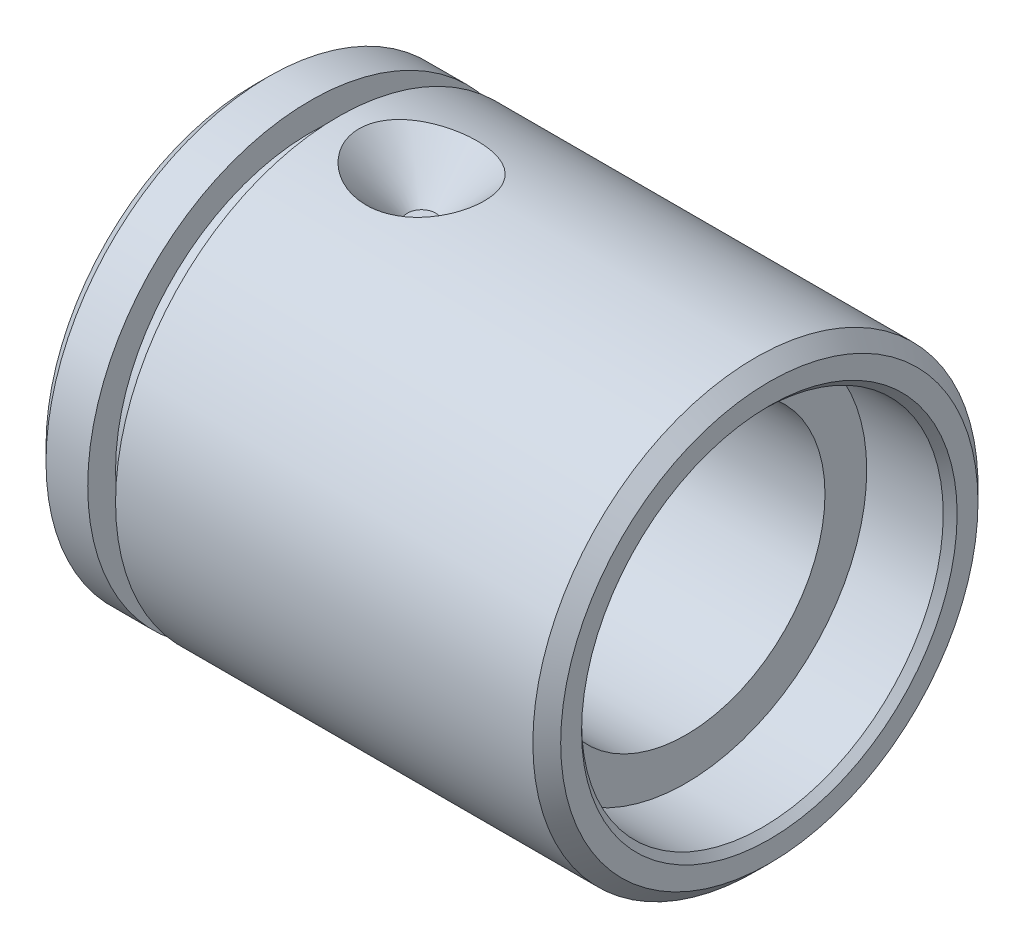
ISO-10303-21;
HEADER;
FILE_DESCRIPTION(('STEP AP214'),'2;1');
FILE_NAME('part.step','',(''),(''),'','','');
FILE_SCHEMA(('AUTOMOTIVE_DESIGN { 1 0 10303 214 1 1 1 1 }'));
ENDSEC;
DATA;
#1=APPLICATION_CONTEXT('core data for automotive mechanical design processes');
#2=APPLICATION_PROTOCOL_DEFINITION('international standard','automotive_design',2000,#1);
#3=PRODUCT_CONTEXT('',#1,'mechanical');
#4=PRODUCT('Part','Part','',(#3));
#5=PRODUCT_RELATED_PRODUCT_CATEGORY('part','',(#4));
#6=PRODUCT_DEFINITION_FORMATION('','',#4);
#7=PRODUCT_DEFINITION_CONTEXT('part definition',#1,'design');
#8=PRODUCT_DEFINITION('design','',#6,#7);
#9=PRODUCT_DEFINITION_SHAPE('','',#8);
#10=(LENGTH_UNIT() NAMED_UNIT(*) SI_UNIT(.MILLI.,.METRE.));
#11=(NAMED_UNIT(*) PLANE_ANGLE_UNIT() SI_UNIT($,.RADIAN.));
#12=(NAMED_UNIT(*) SI_UNIT($,.STERADIAN.) SOLID_ANGLE_UNIT());
#13=UNCERTAINTY_MEASURE_WITH_UNIT(LENGTH_MEASURE(1.E-05),#10,'distance_accuracy_value','');
#14=(GEOMETRIC_REPRESENTATION_CONTEXT(3) GLOBAL_UNCERTAINTY_ASSIGNED_CONTEXT((#13)) GLOBAL_UNIT_ASSIGNED_CONTEXT((#10,
#11,#12)) REPRESENTATION_CONTEXT('',''));
#15=CARTESIAN_POINT('',(0.,0.,0.));
#16=DIRECTION('',(0.,0.,1.));
#17=DIRECTION('',(1.,0.,0.));
#18=AXIS2_PLACEMENT_3D('',#15,#16,#17);
#19=CARTESIAN_POINT('',(37.,0.,0.));
#20=DIRECTION('',(-1.,0.,0.));
#21=DIRECTION('',(0.,0.,1.));
#22=AXIS2_PLACEMENT_3D('',#19,#20,#21);
#23=CYLINDRICAL_SURFACE('',#22,10.);
#24=CARTESIAN_POINT('',(0.5,0.,0.));
#25=DIRECTION('',(1.,0.,0.));
#26=DIRECTION('',(0.,0.,-1.));
#27=AXIS2_PLACEMENT_3D('',#24,#25,#26);
#28=CIRCLE('',#27,10.);
#29=CARTESIAN_POINT('',(0.5,0.,-10.));
#30=VERTEX_POINT('',#29);
#31=EDGE_CURVE('E353',#30,#30,#28,.F.);
#32=ORIENTED_EDGE('',*,*,#31,.T.);
#33=EDGE_LOOP('',(#32));
#34=FACE_BOUND('',#33,.T.);
#35=CARTESIAN_POINT('',(31.,0.,0.));
#36=DIRECTION('',(1.,0.,0.));
#37=DIRECTION('',(0.,0.,-1.));
#38=AXIS2_PLACEMENT_3D('',#35,#36,#37);
#39=CIRCLE('',#38,10.);
#40=CARTESIAN_POINT('',(31.,0.,-10.));
#41=VERTEX_POINT('',#40);
#42=EDGE_CURVE('E454',#41,#41,#39,.F.);
#43=ORIENTED_EDGE('',*,*,#42,.F.);
#44=EDGE_LOOP('',(#43));
#45=FACE_BOUND('',#44,.T.);
#46=ADVANCED_FACE('F346',(#34,#45),#23,.F.);
#47=CARTESIAN_POINT('',(37.,16.,0.));
#48=DIRECTION('',(-1.,0.,0.));
#49=DIRECTION('',(0.,0.,1.));
#50=AXIS2_PLACEMENT_3D('',#47,#48,#49);
#51=PLANE('',#50);
#52=CARTESIAN_POINT('',(37.,0.,0.));
#53=DIRECTION('',(-1.,0.,0.));
#54=DIRECTION('',(0.,0.,1.));
#55=AXIS2_PLACEMENT_3D('',#52,#53,#54);
#56=CIRCLE('',#55,13.5);
#57=CARTESIAN_POINT('',(37.,0.,13.5));
#58=VERTEX_POINT('',#57);
#59=EDGE_CURVE('E357',#58,#58,#56,.T.);
#60=ORIENTED_EDGE('',*,*,#59,.T.);
#61=EDGE_LOOP('',(#60));
#62=FACE_BOUND('',#61,.T.);
#63=CARTESIAN_POINT('',(37.,0.,0.));
#64=DIRECTION('',(-1.,0.,0.));
#65=DIRECTION('',(0.,0.,1.));
#66=AXIS2_PLACEMENT_3D('',#63,#64,#65);
#67=CIRCLE('',#66,15.);
#68=CARTESIAN_POINT('',(37.,0.,15.));
#69=VERTEX_POINT('',#68);
#70=EDGE_CURVE('E451',#69,#69,#67,.F.);
#71=ORIENTED_EDGE('',*,*,#70,.T.);
#72=EDGE_LOOP('',(#71));
#73=FACE_BOUND('',#72,.T.);
#74=ADVANCED_FACE('F348',(#62,#73),#51,.F.);
#75=CARTESIAN_POINT('',(-7.,0.,0.));
#76=DIRECTION('',(-1.,0.,0.));
#77=DIRECTION('',(0.,0.,1.));
#78=AXIS2_PLACEMENT_3D('',#75,#76,#77);
#79=CYLINDRICAL_SURFACE('',#78,16.);
#80=CARTESIAN_POINT('',(9.0552587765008,15.7135972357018,-3.01378337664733));
#81=CARTESIAN_POINT('',(9.26037503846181,15.6832908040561,-3.17181220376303));
#82=CARTESIAN_POINT('',(9.4796245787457,15.6539405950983,-3.31202043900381));
#83=CARTESIAN_POINT('',(9.93902972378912,15.6006630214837,-3.55454733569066));
#84=CARTESIAN_POINT('',(10.1792222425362,15.5767455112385,-3.65679735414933));
#85=CARTESIAN_POINT('',(10.6744522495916,15.5370170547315,-3.82209155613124));
#86=CARTESIAN_POINT('',(10.9295450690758,15.5212387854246,-3.8849779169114));
#87=CARTESIAN_POINT('',(11.4467160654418,15.4997310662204,-3.969920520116));
#88=CARTESIAN_POINT('',(11.7087914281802,15.493997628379,-3.99199296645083));
#89=CARTESIAN_POINT('',(12.2433860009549,15.4932057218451,-3.99507351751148));
#90=CARTESIAN_POINT('',(12.5159167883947,15.4985690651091,-3.9744589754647));
#91=CARTESIAN_POINT('',(13.0536345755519,15.5201846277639,-3.88918644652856));
#92=CARTESIAN_POINT('',(13.3188195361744,15.5364398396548,-3.82451635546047));
#93=CARTESIAN_POINT('',(13.8344440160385,15.5778798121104,-3.65205455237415));
#94=CARTESIAN_POINT('',(14.0848652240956,15.6030754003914,-3.54421053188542));
#95=CARTESIAN_POINT('',(14.5628354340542,15.6592767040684,-3.28699294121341));
#96=CARTESIAN_POINT('',(14.7903823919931,15.6902829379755,-3.13761566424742));
#97=CARTESIAN_POINT('',(15.2068917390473,15.7529772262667,-2.80556774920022));
#98=CARTESIAN_POINT('',(15.396912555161,15.7846050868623,-2.62421990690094));
#99=CARTESIAN_POINT('',(15.7393657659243,15.845303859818,-2.22849689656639));
#100=CARTESIAN_POINT('',(15.8918306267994,15.8743769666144,-2.01415051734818));
#101=CARTESIAN_POINT('',(16.1366949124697,15.9228773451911,-1.5824055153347));
#102=CARTESIAN_POINT('',(16.2337445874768,15.9429999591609,-1.36773255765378));
#103=CARTESIAN_POINT('',(16.384856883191,15.974887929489,-0.923213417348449));
#104=CARTESIAN_POINT('',(16.4389721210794,15.9866635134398,-0.693386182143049));
#105=CARTESIAN_POINT('',(16.4964329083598,15.9992027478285,-0.258067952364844));
#106=CARTESIAN_POINT('',(16.5055251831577,16.0012122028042,-0.053357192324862));
#107=CARTESIAN_POINT('',(16.4880204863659,15.9973714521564,0.354428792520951));
#108=CARTESIAN_POINT('',(16.4614332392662,15.9915233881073,0.557504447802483));
#109=CARTESIAN_POINT('',(16.3763510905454,15.9731586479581,0.945557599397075));
#110=CARTESIAN_POINT('',(16.3195521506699,15.9609971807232,1.13092993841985));
#111=CARTESIAN_POINT('',(16.1778736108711,15.9314799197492,1.49012031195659));
#112=CARTESIAN_POINT('',(16.0929891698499,15.9141232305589,1.66393634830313));
#113=CARTESIAN_POINT('',(15.8925905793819,15.8746600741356,2.00667157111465));
#114=CARTESIAN_POINT('',(15.7755354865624,15.8523299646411,2.17466014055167));
#115=CARTESIAN_POINT('',(15.517794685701,15.8057039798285,2.49105382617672));
#116=CARTESIAN_POINT('',(15.3770986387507,15.7814072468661,2.63945032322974));
#117=CARTESIAN_POINT('',(15.0578787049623,15.7299474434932,2.93143994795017));
#118=CARTESIAN_POINT('',(14.8768379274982,15.7027929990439,3.07228292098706));
#119=CARTESIAN_POINT('',(14.4953568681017,15.6511798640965,3.32524673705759));
#120=CARTESIAN_POINT('',(14.2949073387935,15.6267224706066,3.43735379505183));
#121=CARTESIAN_POINT('',(13.8562498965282,15.5802763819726,3.64243147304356));
#122=CARTESIAN_POINT('',(13.6163243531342,15.5588674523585,3.73187215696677));
#123=CARTESIAN_POINT('',(13.1249279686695,15.5244732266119,3.87246425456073));
#124=CARTESIAN_POINT('',(12.8734540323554,15.5114902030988,3.92360533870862));
#125=CARTESIAN_POINT('',(12.3511724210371,15.4949128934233,3.98859894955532));
#126=CARTESIAN_POINT('',(12.0800666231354,15.4918800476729,4.00022294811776));
#127=CARTESIAN_POINT('',(11.5396027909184,15.4971508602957,3.9797497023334));
#128=CARTESIAN_POINT('',(11.2702449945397,15.5054560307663,3.9476466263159));
#129=CARTESIAN_POINT('',(10.7379583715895,15.532548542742,3.83966819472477));
#130=CARTESIAN_POINT('',(10.4751289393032,15.5514468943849,3.76332898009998));
#131=CARTESIAN_POINT('',(9.96662342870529,15.5974859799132,3.56769965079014));
#132=CARTESIAN_POINT('',(9.72095041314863,15.6246281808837,3.44840189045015));
#133=CARTESIAN_POINT('',(9.25872710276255,15.6832443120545,3.17104879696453));
#134=CARTESIAN_POINT('',(9.04175478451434,15.7146372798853,3.01368257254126));
#135=CARTESIAN_POINT('',(8.64036797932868,15.7780560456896,2.6617264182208));
#136=CARTESIAN_POINT('',(8.455940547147,15.8100815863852,2.46715135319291));
#137=CARTESIAN_POINT('',(8.14152290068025,15.8678445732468,2.06156628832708));
#138=CARTESIAN_POINT('',(8.00839843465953,15.8938781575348,1.85304069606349));
#139=CARTESIAN_POINT('',(7.7849812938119,15.9389600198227,1.4135193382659));
#140=CARTESIAN_POINT('',(7.69463096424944,15.9580176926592,1.18255432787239));
#141=CARTESIAN_POINT('',(7.5718005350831,15.9842809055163,0.73853002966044));
#142=CARTESIAN_POINT('',(7.53317265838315,15.9927355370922,0.527238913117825));
#143=CARTESIAN_POINT('',(7.49496599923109,16.0010964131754,0.101026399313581));
#144=CARTESIAN_POINT('',(7.49536249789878,16.0010080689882,-0.113892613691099));
#145=CARTESIAN_POINT('',(7.53330560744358,15.9927078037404,-0.520529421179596));
#146=CARTESIAN_POINT('',(7.56749047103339,15.9852310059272,-0.712588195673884));
#147=CARTESIAN_POINT('',(7.66630748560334,15.9640513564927,-1.08834393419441));
#148=CARTESIAN_POINT('',(7.73094673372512,15.9503470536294,-1.27203893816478));
#149=CARTESIAN_POINT('',(7.8895455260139,15.9177180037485,-1.63079567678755));
#150=CARTESIAN_POINT('',(7.9841442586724,15.8986806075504,-1.80556230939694));
#151=CARTESIAN_POINT('',(8.19836805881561,15.8573445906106,-2.13840315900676));
#152=CARTESIAN_POINT('',(8.31798181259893,15.8350474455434,-2.29648487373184));
#153=CARTESIAN_POINT('',(8.53970249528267,15.79591467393,-2.5495655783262));
#154=CARTESIAN_POINT('',(8.63647481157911,15.7794213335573,-2.64936560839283));
#155=CARTESIAN_POINT('',(8.83922814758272,15.746392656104,-2.83908155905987));
#156=CARTESIAN_POINT('',(8.94520928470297,15.7298573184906,-2.92899735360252));
#157=CARTESIAN_POINT('',(9.0552587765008,15.7135972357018,-3.01378337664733));
#158=B_SPLINE_CURVE_WITH_KNOTS('',3,(#80,#81,#82,#83,#84,#85,#86,#87,#88,#89,#90,#91,#92,#93,
#94,#95,#96,#97,#98,#99,#100,#101,#102,#103,#104,#105,#106,#107,#108,#109,#110,#111,#112,#113,
#114,#115,#116,#117,#118,#119,#120,#121,#122,#123,#124,#125,#126,#127,#128,#129,#130,#131,#132,
#133,#134,#135,#136,#137,#138,#139,#140,#141,#142,#143,#144,#145,#146,#147,#148,#149,#150,#151,
#152,#153,#154,#155,#156,#157),.UNSPECIFIED.,.T.,.F.,(4,2,2,2,2,2,2,2,2,2,2,2,2,2,2,2,2,2,2,2,2,
2,2,2,2,2,2,2,2,2,2,2,2,2,2,2,2,2,4),(0.,0.781580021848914,1.56456663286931,2.3506727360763,
3.13646667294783,3.95267816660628,4.76911400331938,5.58654202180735,6.40404301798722,
7.19340815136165,7.98208848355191,8.68727070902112,9.39158737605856,10.0031652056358,
10.6145763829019,11.1948141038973,11.7751518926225,12.3905586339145,13.0062352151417,
13.6963522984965,14.3867998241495,15.1542710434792,15.9219491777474,16.7322599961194,
17.5426788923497,18.3617536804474,19.1809743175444,19.9863494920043,20.791403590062,
21.5333424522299,22.2742783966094,22.9155873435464,23.5564900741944,24.1394528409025,
24.722551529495,25.3190397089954,25.9152586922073,26.3345886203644,26.7539238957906),.UNSPECIFIED.);
#159=CARTESIAN_POINT('',(9.0552587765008,15.7135972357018,-3.01378337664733));
#160=VERTEX_POINT('',#159);
#161=EDGE_CURVE('E364',#160,#160,#158,.T.);
#162=ORIENTED_EDGE('',*,*,#161,.T.);
#163=EDGE_LOOP('',(#162));
#164=FACE_BOUND('',#163,.T.);
#165=CARTESIAN_POINT('',(36.,0.,0.));
#166=DIRECTION('',(-1.,0.,0.));
#167=DIRECTION('',(0.,0.,1.));
#168=AXIS2_PLACEMENT_3D('',#165,#166,#167);
#169=CIRCLE('',#168,16.);
#170=CARTESIAN_POINT('',(36.,0.,16.));
#171=VERTEX_POINT('',#170);
#172=EDGE_CURVE('E448',#171,#171,#169,.T.);
#173=ORIENTED_EDGE('',*,*,#172,.T.);
#174=EDGE_LOOP('',(#173));
#175=FACE_BOUND('',#174,.T.);
#176=CARTESIAN_POINT('',(6.,0.,0.));
#177=DIRECTION('',(-1.,0.,0.));
#178=DIRECTION('',(0.,0.,1.));
#179=AXIS2_PLACEMENT_3D('',#176,#177,#178);
#180=CIRCLE('',#179,16.);
#181=CARTESIAN_POINT('',(6.,0.,16.));
#182=VERTEX_POINT('',#181);
#183=EDGE_CURVE('E435',#182,#182,#180,.T.);
#184=ORIENTED_EDGE('',*,*,#183,.F.);
#185=EDGE_LOOP('',(#184));
#186=FACE_BOUND('',#185,.T.);
#187=ADVANCED_FACE('F372',(#164,#175,#186),#79,.T.);
#188=CARTESIAN_POINT('',(6.,14.,0.));
#189=DIRECTION('',(1.,0.,0.));
#190=DIRECTION('',(0.,0.,-1.));
#191=AXIS2_PLACEMENT_3D('',#188,#189,#190);
#192=PLANE('',#191);
#193=CARTESIAN_POINT('',(6.,0.,0.));
#194=DIRECTION('',(-1.,0.,0.));
#195=DIRECTION('',(0.,0.,1.));
#196=AXIS2_PLACEMENT_3D('',#193,#194,#195);
#197=CIRCLE('',#196,14.);
#198=CARTESIAN_POINT('',(6.,0.,14.));
#199=VERTEX_POINT('',#198);
#200=EDGE_CURVE('E432',#199,#199,#197,.T.);
#201=ORIENTED_EDGE('',*,*,#200,.F.);
#202=EDGE_LOOP('',(#201));
#203=FACE_BOUND('',#202,.T.);
#204=ORIENTED_EDGE('',*,*,#183,.T.);
#205=EDGE_LOOP('',(#204));
#206=FACE_BOUND('',#205,.T.);
#207=ADVANCED_FACE('F421',(#203,#206),#192,.F.);
#208=CARTESIAN_POINT('',(-7.,0.,0.));
#209=DIRECTION('',(-1.,0.,0.));
#210=DIRECTION('',(0.,0.,1.));
#211=AXIS2_PLACEMENT_3D('',#208,#209,#210);
#212=CYLINDRICAL_SURFACE('',#211,14.);
#213=CARTESIAN_POINT('',(4.,0.,0.));
#214=DIRECTION('',(-1.,0.,0.));
#215=DIRECTION('',(0.,0.,1.));
#216=AXIS2_PLACEMENT_3D('',#213,#214,#215);
#217=CIRCLE('',#216,14.);
#218=CARTESIAN_POINT('',(4.,0.,14.));
#219=VERTEX_POINT('',#218);
#220=EDGE_CURVE('E442',#219,#219,#217,.T.);
#221=ORIENTED_EDGE('',*,*,#220,.F.);
#222=EDGE_LOOP('',(#221));
#223=FACE_BOUND('',#222,.T.);
#224=ORIENTED_EDGE('',*,*,#200,.T.);
#225=EDGE_LOOP('',(#224));
#226=FACE_BOUND('',#225,.T.);
#227=ADVANCED_FACE('F418',(#223,#226),#212,.T.);
#228=CARTESIAN_POINT('',(4.,16.,0.));
#229=DIRECTION('',(-1.,0.,0.));
#230=DIRECTION('',(0.,0.,1.));
#231=AXIS2_PLACEMENT_3D('',#228,#229,#230);
#232=PLANE('',#231);
#233=CARTESIAN_POINT('',(4.,0.,0.));
#234=DIRECTION('',(-1.,0.,0.));
#235=DIRECTION('',(0.,0.,1.));
#236=AXIS2_PLACEMENT_3D('',#233,#234,#235);
#237=CIRCLE('',#236,16.);
#238=CARTESIAN_POINT('',(4.,0.,16.));
#239=VERTEX_POINT('',#238);
#240=EDGE_CURVE('E456',#239,#239,#237,.T.);
#241=ORIENTED_EDGE('',*,*,#240,.F.);
#242=EDGE_LOOP('',(#241));
#243=FACE_BOUND('',#242,.T.);
#244=ORIENTED_EDGE('',*,*,#220,.T.);
#245=EDGE_LOOP('',(#244));
#246=FACE_BOUND('',#245,.T.);
#247=ADVANCED_FACE('F414',(#243,#246),#232,.F.);
#248=CARTESIAN_POINT('',(-7.,0.,0.));
#249=DIRECTION('',(-1.,0.,0.));
#250=DIRECTION('',(0.,0.,1.));
#251=AXIS2_PLACEMENT_3D('',#248,#249,#250);
#252=CYLINDRICAL_SURFACE('',#251,16.);
#253=CARTESIAN_POINT('',(1.00000000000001,0.,0.));
#254=DIRECTION('',(1.,0.,0.));
#255=DIRECTION('',(0.,0.,-1.));
#256=AXIS2_PLACEMENT_3D('',#253,#254,#255);
#257=CIRCLE('',#256,16.);
#258=CARTESIAN_POINT('',(1.00000000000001,0.,-16.));
#259=VERTEX_POINT('',#258);
#260=EDGE_CURVE('E440',#259,#259,#257,.T.);
#261=ORIENTED_EDGE('',*,*,#260,.T.);
#262=EDGE_LOOP('',(#261));
#263=FACE_BOUND('',#262,.T.);
#264=ORIENTED_EDGE('',*,*,#240,.T.);
#265=EDGE_LOOP('',(#264));
#266=FACE_BOUND('',#265,.T.);
#267=ADVANCED_FACE('F411',(#263,#266),#252,.T.);
#268=CARTESIAN_POINT('',(0.,0.,0.));
#269=DIRECTION('',(1.,0.,0.));
#270=DIRECTION('',(0.,0.,-1.));
#271=AXIS2_PLACEMENT_3D('',#268,#269,#270);
#272=PLANE('',#271);
#273=CARTESIAN_POINT('',(0.,0.,0.));
#274=DIRECTION('',(1.,0.,0.));
#275=DIRECTION('',(0.,0.,-1.));
#276=AXIS2_PLACEMENT_3D('',#273,#274,#275);
#277=CIRCLE('',#276,10.5);
#278=CARTESIAN_POINT('',(0.,0.,-10.5));
#279=VERTEX_POINT('',#278);
#280=EDGE_CURVE('E10',#279,#279,#277,.T.);
#281=ORIENTED_EDGE('',*,*,#280,.T.);
#282=EDGE_LOOP('',(#281));
#283=FACE_BOUND('',#282,.T.);
#284=CARTESIAN_POINT('',(0.,0.,0.));
#285=DIRECTION('',(1.,0.,0.));
#286=DIRECTION('',(0.,0.,-1.));
#287=AXIS2_PLACEMENT_3D('',#284,#285,#286);
#288=CIRCLE('',#287,15.);
#289=CARTESIAN_POINT('',(0.,0.,-15.));
#290=VERTEX_POINT('',#289);
#291=EDGE_CURVE('E437',#290,#290,#288,.F.);
#292=ORIENTED_EDGE('',*,*,#291,.T.);
#293=EDGE_LOOP('',(#292));
#294=FACE_BOUND('',#293,.T.);
#295=ADVANCED_FACE('F407',(#283,#294),#272,.F.);
#296=CARTESIAN_POINT('',(0.,0.,0.));
#297=DIRECTION('',(1.,0.,0.));
#298=DIRECTION('',(0.,0.,-1.));
#299=AXIS2_PLACEMENT_3D('',#296,#297,#298);
#300=CONICAL_SURFACE('',#299,15.,0.785398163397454);
#301=ORIENTED_EDGE('',*,*,#260,.F.);
#302=EDGE_LOOP('',(#301));
#303=FACE_BOUND('',#302,.T.);
#304=ORIENTED_EDGE('',*,*,#291,.F.);
#305=EDGE_LOOP('',(#304));
#306=FACE_BOUND('',#305,.T.);
#307=ADVANCED_FACE('F403',(#303,#306),#300,.T.);
#308=CARTESIAN_POINT('',(36.,0.,0.));
#309=DIRECTION('',(-1.,0.,0.));
#310=DIRECTION('',(0.,0.,1.));
#311=AXIS2_PLACEMENT_3D('',#308,#309,#310);
#312=CONICAL_SURFACE('',#311,16.,0.785398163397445);
#313=ORIENTED_EDGE('',*,*,#70,.F.);
#314=EDGE_LOOP('',(#313));
#315=FACE_BOUND('',#314,.T.);
#316=ORIENTED_EDGE('',*,*,#172,.F.);
#317=EDGE_LOOP('',(#316));
#318=FACE_BOUND('',#317,.T.);
#319=ADVANCED_FACE('F394',(#315,#318),#312,.T.);
#320=CARTESIAN_POINT('',(31.,0.,0.));
#321=DIRECTION('',(1.,0.,0.));
#322=DIRECTION('',(0.,0.,-1.));
#323=AXIS2_PLACEMENT_3D('',#320,#321,#322);
#324=PLANE('',#323);
#325=CARTESIAN_POINT('',(31.,0.,0.));
#326=DIRECTION('',(1.,0.,0.));
#327=DIRECTION('',(0.,0.,-1.));
#328=AXIS2_PLACEMENT_3D('',#325,#326,#327);
#329=CIRCLE('',#328,13.);
#330=CARTESIAN_POINT('',(31.,0.,-13.));
#331=VERTEX_POINT('',#330);
#332=EDGE_CURVE('E369',#331,#331,#329,.T.);
#333=ORIENTED_EDGE('',*,*,#332,.T.);
#334=EDGE_LOOP('',(#333));
#335=FACE_BOUND('',#334,.T.);
#336=ORIENTED_EDGE('',*,*,#42,.T.);
#337=EDGE_LOOP('',(#336));
#338=FACE_BOUND('',#337,.T.);
#339=ADVANCED_FACE('F391',(#335,#338),#324,.T.);
#340=CARTESIAN_POINT('',(31.,0.,0.));
#341=DIRECTION('',(1.,0.,0.));
#342=DIRECTION('',(0.,0.,-1.));
#343=AXIS2_PLACEMENT_3D('',#340,#341,#342);
#344=CYLINDRICAL_SURFACE('',#343,13.);
#345=CARTESIAN_POINT('',(36.5,0.,0.));
#346=DIRECTION('',(-1.,0.,0.));
#347=DIRECTION('',(0.,0.,1.));
#348=AXIS2_PLACEMENT_3D('',#345,#346,#347);
#349=CIRCLE('',#348,13.);
#350=CARTESIAN_POINT('',(36.5,0.,13.));
#351=VERTEX_POINT('',#350);
#352=EDGE_CURVE('E361',#351,#351,#349,.F.);
#353=ORIENTED_EDGE('',*,*,#352,.T.);
#354=EDGE_LOOP('',(#353));
#355=FACE_BOUND('',#354,.T.);
#356=ORIENTED_EDGE('',*,*,#332,.F.);
#357=EDGE_LOOP('',(#356));
#358=FACE_BOUND('',#357,.T.);
#359=ADVANCED_FACE('F389',(#355,#358),#344,.F.);
#360=CARTESIAN_POINT('',(36.5,0.,0.));
#361=DIRECTION('',(1.,0.,0.));
#362=DIRECTION('',(0.,0.,-1.));
#363=AXIS2_PLACEMENT_3D('',#360,#361,#362);
#364=CONICAL_SURFACE('',#363,13.,0.785398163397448);
#365=ORIENTED_EDGE('',*,*,#59,.F.);
#366=EDGE_LOOP('',(#365));
#367=FACE_BOUND('',#366,.T.);
#368=ORIENTED_EDGE('',*,*,#352,.F.);
#369=EDGE_LOOP('',(#368));
#370=FACE_BOUND('',#369,.T.);
#371=ADVANCED_FACE('F381',(#367,#370),#364,.F.);
#372=CARTESIAN_POINT('',(12.,16.5,0.));
#373=DIRECTION('',(0.,1.,0.));
#374=DIRECTION('',(0.,0.,1.));
#375=AXIS2_PLACEMENT_3D('',#372,#373,#374);
#376=CONICAL_SURFACE('',#375,5.,0.785398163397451);
#377=CARTESIAN_POINT('',(12.,12.5,0.));
#378=DIRECTION('',(0.,1.,0.));
#379=DIRECTION('',(0.,0.,1.));
#380=AXIS2_PLACEMENT_3D('',#377,#378,#379);
#381=CIRCLE('',#380,0.999999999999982);
#382=CARTESIAN_POINT('',(12.,12.5,0.999999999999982));
#383=VERTEX_POINT('',#382);
#384=EDGE_CURVE('E370',#383,#383,#381,.T.);
#385=ORIENTED_EDGE('',*,*,#384,.F.);
#386=EDGE_LOOP('',(#385));
#387=FACE_BOUND('',#386,.T.);
#388=ORIENTED_EDGE('',*,*,#161,.F.);
#389=EDGE_LOOP('',(#388));
#390=FACE_BOUND('',#389,.T.);
#391=ADVANCED_FACE('F375',(#387,#390),#376,.F.);
#392=CARTESIAN_POINT('',(11.,12.5,0.));
#393=DIRECTION('',(0.,-1.,0.));
#394=DIRECTION('',(0.,0.,-1.));
#395=AXIS2_PLACEMENT_3D('',#392,#393,#394);
#396=PLANE('',#395);
#397=ORIENTED_EDGE('',*,*,#384,.T.);
#398=EDGE_LOOP('',(#397));
#399=FACE_BOUND('',#398,.T.);
#400=ADVANCED_FACE('F380',(#399),#396,.F.);
#401=CARTESIAN_POINT('',(0.5,0.,0.));
#402=DIRECTION('',(-1.,0.,0.));
#403=DIRECTION('',(0.,0.,1.));
#404=AXIS2_PLACEMENT_3D('',#401,#402,#403);
#405=CONICAL_SURFACE('',#404,10.,0.785398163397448);
#406=ORIENTED_EDGE('',*,*,#280,.F.);
#407=EDGE_LOOP('',(#406));
#408=FACE_BOUND('',#407,.T.);
#409=ORIENTED_EDGE('',*,*,#31,.F.);
#410=EDGE_LOOP('',(#409));
#411=FACE_BOUND('',#410,.T.);
#412=ADVANCED_FACE('F383',(#408,#411),#405,.F.);
#413=CLOSED_SHELL('',(#46,#74,#187,#207,#227,#247,#267,#295,#307,#319,#339,#359,#371,#391,#400,#412));
#414=MANIFOLD_SOLID_BREP('B2',#413);
#415=ADVANCED_BREP_SHAPE_REPRESENTATION('',(#18,#414),#14);
#416=SHAPE_DEFINITION_REPRESENTATION(#9,#415);
ENDSEC;
END-ISO-10303-21;
